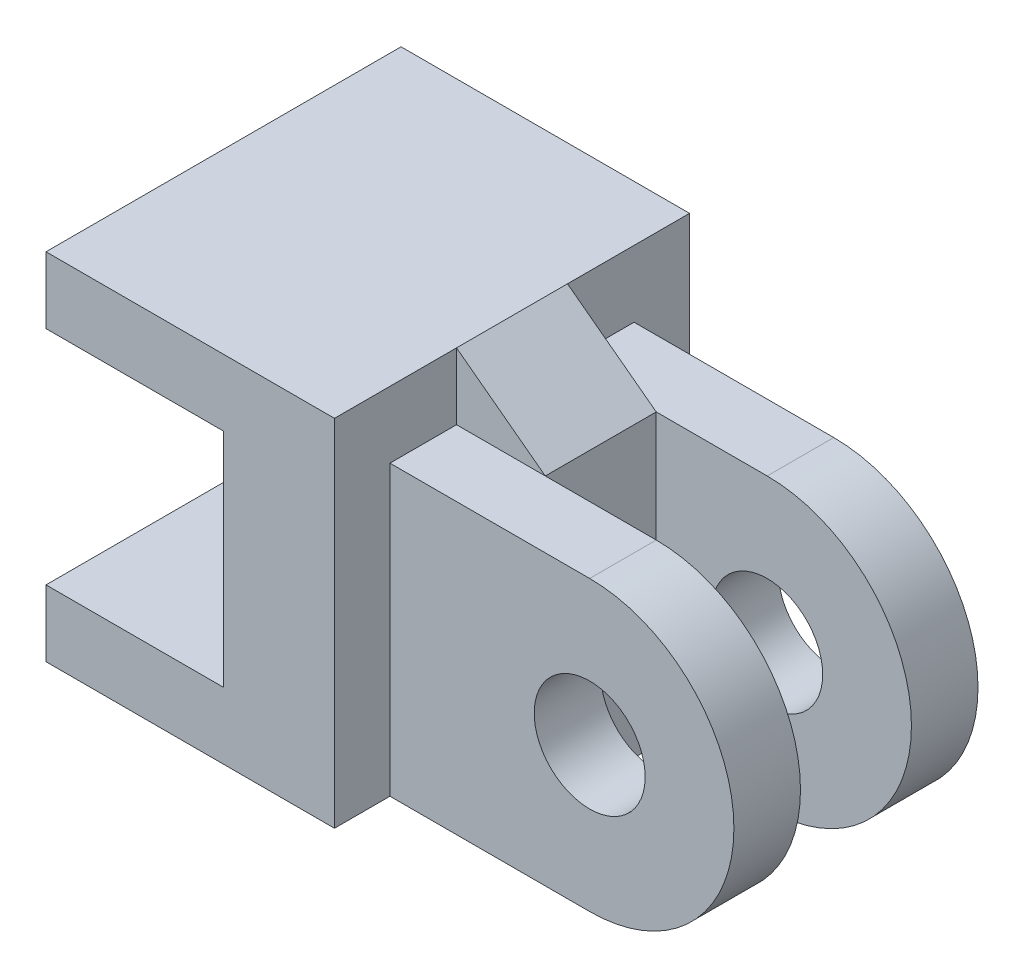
ISO-10303-21;
HEADER;
FILE_DESCRIPTION(('STEP AP214'),'2;1');
FILE_NAME('part.step','',(''),(''),'','','');
FILE_SCHEMA(('AUTOMOTIVE_DESIGN { 1 0 10303 214 1 1 1 1 }'));
ENDSEC;
DATA;
#1=APPLICATION_CONTEXT('core data for automotive mechanical design processes');
#2=APPLICATION_PROTOCOL_DEFINITION('international standard','automotive_design',2000,#1);
#3=PRODUCT_CONTEXT('',#1,'mechanical');
#4=PRODUCT('Part','Part','',(#3));
#5=PRODUCT_RELATED_PRODUCT_CATEGORY('part','',(#4));
#6=PRODUCT_DEFINITION_FORMATION('','',#4);
#7=PRODUCT_DEFINITION_CONTEXT('part definition',#1,'design');
#8=PRODUCT_DEFINITION('design','',#6,#7);
#9=PRODUCT_DEFINITION_SHAPE('','',#8);
#10=(LENGTH_UNIT() NAMED_UNIT(*) SI_UNIT(.MILLI.,.METRE.));
#11=(NAMED_UNIT(*) PLANE_ANGLE_UNIT() SI_UNIT($,.RADIAN.));
#12=(NAMED_UNIT(*) SI_UNIT($,.STERADIAN.) SOLID_ANGLE_UNIT());
#13=UNCERTAINTY_MEASURE_WITH_UNIT(LENGTH_MEASURE(1.E-05),#10,'distance_accuracy_value','');
#14=(GEOMETRIC_REPRESENTATION_CONTEXT(3) GLOBAL_UNCERTAINTY_ASSIGNED_CONTEXT((#13)) GLOBAL_UNIT_ASSIGNED_CONTEXT((#10,
#11,#12)) REPRESENTATION_CONTEXT('',''));
#15=CARTESIAN_POINT('',(0.,0.,0.));
#16=DIRECTION('',(0.,0.,1.));
#17=DIRECTION('',(1.,0.,0.));
#18=AXIS2_PLACEMENT_3D('',#15,#16,#17);
#19=CARTESIAN_POINT('',(25.,-40.,-12.5));
#20=DIRECTION('',(0.,0.,1.));
#21=DIRECTION('',(1.,0.,0.));
#22=AXIS2_PLACEMENT_3D('',#19,#20,#21);
#23=PLANE('',#22);
#24=DIRECTION('',(1.,0.,0.));
#25=VECTOR('',#24,1.);
#26=CARTESIAN_POINT('',(25.,25.,-12.5));
#27=LINE('',#26,#25);
#28=CARTESIAN_POINT('',(25.,25.,-12.5));
#29=VERTEX_POINT('',#28);
#30=CARTESIAN_POINT('',(45.,25.,-12.5));
#31=VERTEX_POINT('',#30);
#32=EDGE_CURVE('E187',#29,#31,#27,.T.);
#33=ORIENTED_EDGE('',*,*,#32,.F.);
#34=DIRECTION('',(0.,-1.,0.));
#35=VECTOR('',#34,1.);
#36=CARTESIAN_POINT('',(25.,-40.,-12.5));
#37=LINE('',#36,#35);
#38=CARTESIAN_POINT('',(25.,40.,-12.5));
#39=VERTEX_POINT('',#38);
#40=EDGE_CURVE('E224',#39,#29,#37,.T.);
#41=ORIENTED_EDGE('',*,*,#40,.F.);
#42=DIRECTION('',(-0.8,0.6,0.));
#43=VECTOR('',#42,1.);
#44=CARTESIAN_POINT('',(25.,40.,-12.5));
#45=LINE('',#44,#43);
#46=EDGE_CURVE('E231',#31,#39,#45,.T.);
#47=ORIENTED_EDGE('',*,*,#46,.F.);
#48=EDGE_LOOP('',(#33,#41,#47));
#49=FACE_BOUND('',#48,.T.);
#50=ADVANCED_FACE('F33',(#49),#23,.F.);
#51=CARTESIAN_POINT('',(25.,-40.,12.5));
#52=DIRECTION('',(0.,0.,1.));
#53=DIRECTION('',(1.,0.,0.));
#54=AXIS2_PLACEMENT_3D('',#51,#52,#53);
#55=PLANE('',#54);
#56=DIRECTION('',(0.,-1.,0.));
#57=VECTOR('',#56,1.);
#58=CARTESIAN_POINT('',(25.,-40.,12.5));
#59=LINE('',#58,#57);
#60=CARTESIAN_POINT('',(25.,40.,12.5));
#61=VERTEX_POINT('',#60);
#62=CARTESIAN_POINT('',(25.,25.,12.5));
#63=VERTEX_POINT('',#62);
#64=EDGE_CURVE('E236',#61,#63,#59,.T.);
#65=ORIENTED_EDGE('',*,*,#64,.T.);
#66=DIRECTION('',(1.,0.,0.));
#67=VECTOR('',#66,1.);
#68=CARTESIAN_POINT('',(25.,25.,12.5));
#69=LINE('',#68,#67);
#70=CARTESIAN_POINT('',(45.,25.,12.5));
#71=VERTEX_POINT('',#70);
#72=EDGE_CURVE('E11',#63,#71,#69,.T.);
#73=ORIENTED_EDGE('',*,*,#72,.T.);
#74=DIRECTION('',(-0.8,0.6,0.));
#75=VECTOR('',#74,1.);
#76=CARTESIAN_POINT('',(25.,40.,12.5));
#77=LINE('',#76,#75);
#78=EDGE_CURVE('E243',#71,#61,#77,.T.);
#79=ORIENTED_EDGE('',*,*,#78,.T.);
#80=EDGE_LOOP('',(#65,#73,#79));
#81=FACE_BOUND('',#80,.T.);
#82=ADVANCED_FACE('F335',(#81),#55,.T.);
#83=CARTESIAN_POINT('',(25.,40.,40.));
#84=DIRECTION('',(-1.,0.,0.));
#85=DIRECTION('',(0.,0.,1.));
#86=AXIS2_PLACEMENT_3D('',#83,#84,#85);
#87=PLANE('',#86);
#88=DIRECTION('',(0.,0.,-1.));
#89=VECTOR('',#88,1.);
#90=CARTESIAN_POINT('',(25.,-40.,40.));
#91=LINE('',#90,#89);
#92=CARTESIAN_POINT('',(25.,-40.,40.));
#93=VERTEX_POINT('',#92);
#94=CARTESIAN_POINT('',(25.,-40.,27.5));
#95=VERTEX_POINT('',#94);
#96=EDGE_CURVE('E251',#93,#95,#91,.T.);
#97=ORIENTED_EDGE('',*,*,#96,.T.);
#98=DIRECTION('',(0.,-1.,0.));
#99=VECTOR('',#98,1.);
#100=CARTESIAN_POINT('',(25.,25.,27.5));
#101=LINE('',#100,#99);
#102=CARTESIAN_POINT('',(25.,25.,27.5));
#103=VERTEX_POINT('',#102);
#104=EDGE_CURVE('E206',#103,#95,#101,.T.);
#105=ORIENTED_EDGE('',*,*,#104,.F.);
#106=DIRECTION('',(0.,0.,-1.));
#107=VECTOR('',#106,1.);
#108=CARTESIAN_POINT('',(25.,25.,27.5));
#109=LINE('',#108,#107);
#110=EDGE_CURVE('E215',#103,#63,#109,.T.);
#111=ORIENTED_EDGE('',*,*,#110,.T.);
#112=ORIENTED_EDGE('',*,*,#64,.F.);
#113=DIRECTION('',(0.,0.,-1.));
#114=VECTOR('',#113,1.);
#115=CARTESIAN_POINT('',(25.,40.,40.));
#116=LINE('',#115,#114);
#117=CARTESIAN_POINT('',(25.,40.,40.));
#118=VERTEX_POINT('',#117);
#119=EDGE_CURVE('E272',#118,#61,#116,.T.);
#120=ORIENTED_EDGE('',*,*,#119,.F.);
#121=DIRECTION('',(0.,1.,0.));
#122=VECTOR('',#121,1.);
#123=CARTESIAN_POINT('',(25.,40.,40.));
#124=LINE('',#123,#122);
#125=EDGE_CURVE('E292',#93,#118,#124,.T.);
#126=ORIENTED_EDGE('',*,*,#125,.F.);
#127=EDGE_LOOP('',(#97,#105,#111,#112,#120,#126));
#128=FACE_BOUND('',#127,.T.);
#129=ADVANCED_FACE('F357',(#128),#87,.F.);
#130=CARTESIAN_POINT('',(0.,25.,40.));
#131=DIRECTION('',(0.,1.,0.));
#132=DIRECTION('',(-1.,0.,0.));
#133=AXIS2_PLACEMENT_3D('',#130,#131,#132);
#134=PLANE('',#133);
#135=DIRECTION('',(1.,0.,0.));
#136=VECTOR('',#135,1.);
#137=CARTESIAN_POINT('',(0.,25.,-40.));
#138=LINE('',#137,#136);
#139=CARTESIAN_POINT('',(-40.,25.,-40.));
#140=VERTEX_POINT('',#139);
#141=CARTESIAN_POINT('',(0.,25.,-40.));
#142=VERTEX_POINT('',#141);
#143=EDGE_CURVE('E320',#140,#142,#138,.T.);
#144=ORIENTED_EDGE('',*,*,#143,.T.);
#145=DIRECTION('',(0.,0.,-1.));
#146=VECTOR('',#145,1.);
#147=CARTESIAN_POINT('',(0.,25.,40.));
#148=LINE('',#147,#146);
#149=CARTESIAN_POINT('',(0.,25.,40.));
#150=VERTEX_POINT('',#149);
#151=EDGE_CURVE('E43',#150,#142,#148,.T.);
#152=ORIENTED_EDGE('',*,*,#151,.F.);
#153=DIRECTION('',(1.,0.,0.));
#154=VECTOR('',#153,1.);
#155=CARTESIAN_POINT('',(0.,25.,40.));
#156=LINE('',#155,#154);
#157=CARTESIAN_POINT('',(-40.,25.,40.));
#158=VERTEX_POINT('',#157);
#159=EDGE_CURVE('E302',#158,#150,#156,.T.);
#160=ORIENTED_EDGE('',*,*,#159,.F.);
#161=DIRECTION('',(0.,0.,-1.));
#162=VECTOR('',#161,1.);
#163=CARTESIAN_POINT('',(-40.,25.,40.));
#164=LINE('',#163,#162);
#165=EDGE_CURVE('E280',#158,#140,#164,.T.);
#166=ORIENTED_EDGE('',*,*,#165,.T.);
#167=EDGE_LOOP('',(#144,#152,#160,#166));
#168=FACE_BOUND('',#167,.T.);
#169=ADVANCED_FACE('F35',(#168),#134,.F.);
#170=CARTESIAN_POINT('',(0.,-25.,40.));
#171=DIRECTION('',(1.,0.,0.));
#172=DIRECTION('',(0.,0.,-1.));
#173=AXIS2_PLACEMENT_3D('',#170,#171,#172);
#174=PLANE('',#173);
#175=DIRECTION('',(0.,-1.,0.));
#176=VECTOR('',#175,1.);
#177=CARTESIAN_POINT('',(0.,-25.,-40.));
#178=LINE('',#177,#176);
#179=CARTESIAN_POINT('',(0.,-25.,-40.));
#180=VERTEX_POINT('',#179);
#181=EDGE_CURVE('E318',#142,#180,#178,.T.);
#182=ORIENTED_EDGE('',*,*,#181,.T.);
#183=DIRECTION('',(0.,0.,-1.));
#184=VECTOR('',#183,1.);
#185=CARTESIAN_POINT('',(0.,-25.,40.));
#186=LINE('',#185,#184);
#187=CARTESIAN_POINT('',(0.,-25.,40.));
#188=VERTEX_POINT('',#187);
#189=EDGE_CURVE('E268',#188,#180,#186,.T.);
#190=ORIENTED_EDGE('',*,*,#189,.F.);
#191=DIRECTION('',(0.,-1.,0.));
#192=VECTOR('',#191,1.);
#193=CARTESIAN_POINT('',(0.,-25.,40.));
#194=LINE('',#193,#192);
#195=EDGE_CURVE('E300',#150,#188,#194,.T.);
#196=ORIENTED_EDGE('',*,*,#195,.F.);
#197=ORIENTED_EDGE('',*,*,#151,.T.);
#198=EDGE_LOOP('',(#182,#190,#196,#197));
#199=FACE_BOUND('',#198,.T.);
#200=ADVANCED_FACE('F388',(#199),#174,.F.);
#201=CARTESIAN_POINT('',(0.,-25.,40.));
#202=DIRECTION('',(0.,-1.,0.));
#203=DIRECTION('',(1.,0.,0.));
#204=AXIS2_PLACEMENT_3D('',#201,#202,#203);
#205=PLANE('',#204);
#206=DIRECTION('',(-1.,0.,0.));
#207=VECTOR('',#206,1.);
#208=CARTESIAN_POINT('',(0.,-25.,-40.));
#209=LINE('',#208,#207);
#210=CARTESIAN_POINT('',(-40.,-25.,-40.));
#211=VERTEX_POINT('',#210);
#212=EDGE_CURVE('E316',#180,#211,#209,.T.);
#213=ORIENTED_EDGE('',*,*,#212,.T.);
#214=DIRECTION('',(0.,0.,-1.));
#215=VECTOR('',#214,1.);
#216=CARTESIAN_POINT('',(-40.,-25.,40.));
#217=LINE('',#216,#215);
#218=CARTESIAN_POINT('',(-40.,-25.,40.));
#219=VERTEX_POINT('',#218);
#220=EDGE_CURVE('E265',#219,#211,#217,.T.);
#221=ORIENTED_EDGE('',*,*,#220,.F.);
#222=DIRECTION('',(-1.,0.,0.));
#223=VECTOR('',#222,1.);
#224=CARTESIAN_POINT('',(0.,-25.,40.));
#225=LINE('',#224,#223);
#226=EDGE_CURVE('E298',#188,#219,#225,.T.);
#227=ORIENTED_EDGE('',*,*,#226,.F.);
#228=ORIENTED_EDGE('',*,*,#189,.T.);
#229=EDGE_LOOP('',(#213,#221,#227,#228));
#230=FACE_BOUND('',#229,.T.);
#231=ADVANCED_FACE('F393',(#230),#205,.F.);
#232=CARTESIAN_POINT('',(-40.,-25.,40.));
#233=DIRECTION('',(1.,0.,0.));
#234=DIRECTION('',(0.,0.,-1.));
#235=AXIS2_PLACEMENT_3D('',#232,#233,#234);
#236=PLANE('',#235);
#237=DIRECTION('',(0.,-1.,0.));
#238=VECTOR('',#237,1.);
#239=CARTESIAN_POINT('',(-40.,-25.,-40.));
#240=LINE('',#239,#238);
#241=CARTESIAN_POINT('',(-40.,-40.,-40.));
#242=VERTEX_POINT('',#241);
#243=EDGE_CURVE('E314',#211,#242,#240,.T.);
#244=ORIENTED_EDGE('',*,*,#243,.T.);
#245=DIRECTION('',(0.,0.,-1.));
#246=VECTOR('',#245,1.);
#247=CARTESIAN_POINT('',(-40.,-40.,40.));
#248=LINE('',#247,#246);
#249=CARTESIAN_POINT('',(-40.,-40.,40.));
#250=VERTEX_POINT('',#249);
#251=EDGE_CURVE('E254',#250,#242,#248,.T.);
#252=ORIENTED_EDGE('',*,*,#251,.F.);
#253=DIRECTION('',(0.,-1.,0.));
#254=VECTOR('',#253,1.);
#255=CARTESIAN_POINT('',(-40.,-25.,40.));
#256=LINE('',#255,#254);
#257=EDGE_CURVE('E296',#219,#250,#256,.T.);
#258=ORIENTED_EDGE('',*,*,#257,.F.);
#259=ORIENTED_EDGE('',*,*,#220,.T.);
#260=EDGE_LOOP('',(#244,#252,#258,#259));
#261=FACE_BOUND('',#260,.T.);
#262=ADVANCED_FACE('F399',(#261),#236,.F.);
#263=CARTESIAN_POINT('',(-40.,-40.,40.));
#264=DIRECTION('',(0.,1.,0.));
#265=DIRECTION('',(-1.,0.,0.));
#266=AXIS2_PLACEMENT_3D('',#263,#264,#265);
#267=PLANE('',#266);
#268=DIRECTION('',(1.,0.,0.));
#269=VECTOR('',#268,1.);
#270=CARTESIAN_POINT('',(25.,-40.,27.5));
#271=LINE('',#270,#269);
#272=CARTESIAN_POINT('',(70.,-40.,27.5));
#273=VERTEX_POINT('',#272);
#274=EDGE_CURVE('E209',#95,#273,#271,.T.);
#275=ORIENTED_EDGE('',*,*,#274,.F.);
#276=ORIENTED_EDGE('',*,*,#96,.F.);
#277=DIRECTION('',(1.,0.,0.));
#278=VECTOR('',#277,1.);
#279=CARTESIAN_POINT('',(-40.,-40.,40.));
#280=LINE('',#279,#278);
#281=EDGE_CURVE('E294',#250,#93,#280,.T.);
#282=ORIENTED_EDGE('',*,*,#281,.F.);
#283=ORIENTED_EDGE('',*,*,#251,.T.);
#284=DIRECTION('',(1.,0.,0.));
#285=VECTOR('',#284,1.);
#286=CARTESIAN_POINT('',(-40.,-40.,-40.));
#287=LINE('',#286,#285);
#288=CARTESIAN_POINT('',(25.,-40.,-40.));
#289=VERTEX_POINT('',#288);
#290=EDGE_CURVE('E311',#242,#289,#287,.T.);
#291=ORIENTED_EDGE('',*,*,#290,.T.);
#292=CARTESIAN_POINT('',(25.,-40.,-27.5));
#293=VERTEX_POINT('',#292);
#294=EDGE_CURVE('E37',#293,#289,#91,.T.);
#295=ORIENTED_EDGE('',*,*,#294,.F.);
#296=DIRECTION('',(1.,0.,0.));
#297=VECTOR('',#296,1.);
#298=CARTESIAN_POINT('',(25.,-40.,-27.5));
#299=LINE('',#298,#297);
#300=CARTESIAN_POINT('',(70.,-40.,-27.5));
#301=VERTEX_POINT('',#300);
#302=EDGE_CURVE('E185',#293,#301,#299,.T.);
#303=ORIENTED_EDGE('',*,*,#302,.T.);
#304=DIRECTION('',(0.,0.,1.));
#305=VECTOR('',#304,1.);
#306=CARTESIAN_POINT('',(70.,-40.,-27.5));
#307=LINE('',#306,#305);
#308=CARTESIAN_POINT('',(70.,-40.,-12.5));
#309=VERTEX_POINT('',#308);
#310=EDGE_CURVE('E165',#301,#309,#307,.T.);
#311=ORIENTED_EDGE('',*,*,#310,.T.);
#312=DIRECTION('',(1.,0.,0.));
#313=VECTOR('',#312,1.);
#314=CARTESIAN_POINT('',(25.,-40.,-12.5));
#315=LINE('',#314,#313);
#316=CARTESIAN_POINT('',(45.,-40.,-12.5));
#317=VERTEX_POINT('',#316);
#318=EDGE_CURVE('E172',#317,#309,#315,.T.);
#319=ORIENTED_EDGE('',*,*,#318,.F.);
#320=DIRECTION('',(0.,0.,-1.));
#321=VECTOR('',#320,1.);
#322=CARTESIAN_POINT('',(45.,-40.,12.5));
#323=LINE('',#322,#321);
#324=CARTESIAN_POINT('',(45.,-40.,12.5));
#325=VERTEX_POINT('',#324);
#326=EDGE_CURVE('E323',#325,#317,#323,.T.);
#327=ORIENTED_EDGE('',*,*,#326,.F.);
#328=DIRECTION('',(1.,0.,0.));
#329=VECTOR('',#328,1.);
#330=CARTESIAN_POINT('',(25.,-40.,12.5));
#331=LINE('',#330,#329);
#332=CARTESIAN_POINT('',(70.,-40.,12.5));
#333=VERTEX_POINT('',#332);
#334=EDGE_CURVE('E200',#325,#333,#331,.T.);
#335=ORIENTED_EDGE('',*,*,#334,.T.);
#336=DIRECTION('',(0.,0.,-1.));
#337=VECTOR('',#336,1.);
#338=CARTESIAN_POINT('',(70.,-40.,27.5));
#339=LINE('',#338,#337);
#340=EDGE_CURVE('E221',#273,#333,#339,.T.);
#341=ORIENTED_EDGE('',*,*,#340,.F.);
#342=EDGE_LOOP('',(#275,#276,#282,#283,#291,#295,#303,#311,#319,#327,#335,#341));
#343=FACE_BOUND('',#342,.T.);
#344=ADVANCED_FACE('F183',(#343),#267,.F.);
#345=DIRECTION('',(0.,0.,1.));
#346=VECTOR('',#345,1.);
#347=CARTESIAN_POINT('',(25.,25.,-27.5));
#348=LINE('',#347,#346);
#349=CARTESIAN_POINT('',(25.,25.,-27.5));
#350=VERTEX_POINT('',#349);
#351=EDGE_CURVE('E50',#350,#29,#348,.T.);
#352=ORIENTED_EDGE('',*,*,#351,.F.);
#353=DIRECTION('',(0.,-1.,0.));
#354=VECTOR('',#353,1.);
#355=CARTESIAN_POINT('',(25.,25.,-27.5));
#356=LINE('',#355,#354);
#357=EDGE_CURVE('E55',#350,#293,#356,.T.);
#358=ORIENTED_EDGE('',*,*,#357,.T.);
#359=ORIENTED_EDGE('',*,*,#294,.T.);
#360=DIRECTION('',(0.,1.,0.));
#361=VECTOR('',#360,1.);
#362=CARTESIAN_POINT('',(25.,40.,-40.));
#363=LINE('',#362,#361);
#364=CARTESIAN_POINT('',(25.,40.,-40.));
#365=VERTEX_POINT('',#364);
#366=EDGE_CURVE('E309',#289,#365,#363,.T.);
#367=ORIENTED_EDGE('',*,*,#366,.T.);
#368=EDGE_CURVE('E255',#39,#365,#116,.T.);
#369=ORIENTED_EDGE('',*,*,#368,.F.);
#370=ORIENTED_EDGE('',*,*,#40,.T.);
#371=EDGE_LOOP('',(#352,#358,#359,#367,#369,#370));
#372=FACE_BOUND('',#371,.T.);
#373=ADVANCED_FACE('F348',(#372),#87,.F.);
#374=CARTESIAN_POINT('',(-40.,40.,40.));
#375=DIRECTION('',(0.,-1.,0.));
#376=DIRECTION('',(1.,0.,0.));
#377=AXIS2_PLACEMENT_3D('',#374,#375,#376);
#378=PLANE('',#377);
#379=DIRECTION('',(-1.,0.,0.));
#380=VECTOR('',#379,1.);
#381=CARTESIAN_POINT('',(-40.,40.,-40.));
#382=LINE('',#381,#380);
#383=CARTESIAN_POINT('',(-40.,40.,-40.));
#384=VERTEX_POINT('',#383);
#385=EDGE_CURVE('E307',#365,#384,#382,.T.);
#386=ORIENTED_EDGE('',*,*,#385,.T.);
#387=DIRECTION('',(0.,0.,-1.));
#388=VECTOR('',#387,1.);
#389=CARTESIAN_POINT('',(-40.,40.,40.));
#390=LINE('',#389,#388);
#391=CARTESIAN_POINT('',(-40.,40.,40.));
#392=VERTEX_POINT('',#391);
#393=EDGE_CURVE('E277',#392,#384,#390,.T.);
#394=ORIENTED_EDGE('',*,*,#393,.F.);
#395=DIRECTION('',(-1.,0.,0.));
#396=VECTOR('',#395,1.);
#397=CARTESIAN_POINT('',(-40.,40.,40.));
#398=LINE('',#397,#396);
#399=EDGE_CURVE('E290',#118,#392,#398,.T.);
#400=ORIENTED_EDGE('',*,*,#399,.F.);
#401=ORIENTED_EDGE('',*,*,#119,.T.);
#402=DIRECTION('',(0.,0.,-1.));
#403=VECTOR('',#402,1.);
#404=CARTESIAN_POINT('',(25.,40.,12.5));
#405=LINE('',#404,#403);
#406=EDGE_CURVE('E239',#61,#39,#405,.T.);
#407=ORIENTED_EDGE('',*,*,#406,.T.);
#408=ORIENTED_EDGE('',*,*,#368,.T.);
#409=EDGE_LOOP('',(#386,#394,#400,#401,#407,#408));
#410=FACE_BOUND('',#409,.T.);
#411=ADVANCED_FACE('F344',(#410),#378,.F.);
#412=CARTESIAN_POINT('',(-40.,25.,40.));
#413=DIRECTION('',(1.,0.,0.));
#414=DIRECTION('',(0.,0.,-1.));
#415=AXIS2_PLACEMENT_3D('',#412,#413,#414);
#416=PLANE('',#415);
#417=DIRECTION('',(0.,-1.,0.));
#418=VECTOR('',#417,1.);
#419=CARTESIAN_POINT('',(-40.,25.,-40.));
#420=LINE('',#419,#418);
#421=EDGE_CURVE('E305',#384,#140,#420,.T.);
#422=ORIENTED_EDGE('',*,*,#421,.T.);
#423=ORIENTED_EDGE('',*,*,#165,.F.);
#424=DIRECTION('',(0.,-1.,0.));
#425=VECTOR('',#424,1.);
#426=CARTESIAN_POINT('',(-40.,25.,40.));
#427=LINE('',#426,#425);
#428=EDGE_CURVE('E286',#392,#158,#427,.T.);
#429=ORIENTED_EDGE('',*,*,#428,.F.);
#430=ORIENTED_EDGE('',*,*,#393,.T.);
#431=EDGE_LOOP('',(#422,#423,#429,#430));
#432=FACE_BOUND('',#431,.T.);
#433=ADVANCED_FACE('F347',(#432),#416,.F.);
#434=CARTESIAN_POINT('',(-40.,25.,40.));
#435=DIRECTION('',(0.,0.,-1.));
#436=DIRECTION('',(-1.,0.,0.));
#437=AXIS2_PLACEMENT_3D('',#434,#435,#436);
#438=PLANE('',#437);
#439=ORIENTED_EDGE('',*,*,#159,.T.);
#440=ORIENTED_EDGE('',*,*,#195,.T.);
#441=ORIENTED_EDGE('',*,*,#226,.T.);
#442=ORIENTED_EDGE('',*,*,#257,.T.);
#443=ORIENTED_EDGE('',*,*,#281,.T.);
#444=ORIENTED_EDGE('',*,*,#125,.T.);
#445=ORIENTED_EDGE('',*,*,#399,.T.);
#446=ORIENTED_EDGE('',*,*,#428,.T.);
#447=EDGE_LOOP('',(#439,#440,#441,#442,#443,#444,#445,#446));
#448=FACE_BOUND('',#447,.T.);
#449=ADVANCED_FACE('F354',(#448),#438,.F.);
#450=CARTESIAN_POINT('',(-40.,25.,-40.));
#451=DIRECTION('',(0.,0.,-1.));
#452=DIRECTION('',(-1.,0.,0.));
#453=AXIS2_PLACEMENT_3D('',#450,#451,#452);
#454=PLANE('',#453);
#455=ORIENTED_EDGE('',*,*,#143,.F.);
#456=ORIENTED_EDGE('',*,*,#421,.F.);
#457=ORIENTED_EDGE('',*,*,#385,.F.);
#458=ORIENTED_EDGE('',*,*,#366,.F.);
#459=ORIENTED_EDGE('',*,*,#290,.F.);
#460=ORIENTED_EDGE('',*,*,#243,.F.);
#461=ORIENTED_EDGE('',*,*,#212,.F.);
#462=ORIENTED_EDGE('',*,*,#181,.F.);
#463=EDGE_LOOP('',(#455,#456,#457,#458,#459,#460,#461,#462));
#464=FACE_BOUND('',#463,.T.);
#465=ADVANCED_FACE('F373',(#464),#454,.T.);
#466=CARTESIAN_POINT('',(45.,25.,12.5));
#467=DIRECTION('',(-1.,0.,0.));
#468=DIRECTION('',(0.,-1.,0.));
#469=AXIS2_PLACEMENT_3D('',#466,#467,#468);
#470=PLANE('',#469);
#471=DIRECTION('',(0.,1.,0.));
#472=VECTOR('',#471,1.);
#473=CARTESIAN_POINT('',(45.,25.,-12.5));
#474=LINE('',#473,#472);
#475=EDGE_CURVE('E178',#317,#31,#474,.T.);
#476=ORIENTED_EDGE('',*,*,#475,.T.);
#477=DIRECTION('',(0.,0.,-1.));
#478=VECTOR('',#477,1.);
#479=CARTESIAN_POINT('',(45.,25.,12.5));
#480=LINE('',#479,#478);
#481=EDGE_CURVE('E242',#71,#31,#480,.T.);
#482=ORIENTED_EDGE('',*,*,#481,.F.);
#483=DIRECTION('',(0.,1.,0.));
#484=VECTOR('',#483,1.);
#485=CARTESIAN_POINT('',(45.,25.,12.5));
#486=LINE('',#485,#484);
#487=EDGE_CURVE('E248',#325,#71,#486,.T.);
#488=ORIENTED_EDGE('',*,*,#487,.F.);
#489=ORIENTED_EDGE('',*,*,#326,.T.);
#490=EDGE_LOOP('',(#476,#482,#488,#489));
#491=FACE_BOUND('',#490,.T.);
#492=ADVANCED_FACE('F340',(#491),#470,.F.);
#493=CARTESIAN_POINT('',(25.,40.,12.5));
#494=DIRECTION('',(-0.599999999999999,-0.8,0.));
#495=DIRECTION('',(0.800000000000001,-0.6,0.));
#496=AXIS2_PLACEMENT_3D('',#493,#494,#495);
#497=PLANE('',#496);
#498=ORIENTED_EDGE('',*,*,#46,.T.);
#499=ORIENTED_EDGE('',*,*,#406,.F.);
#500=ORIENTED_EDGE('',*,*,#78,.F.);
#501=ORIENTED_EDGE('',*,*,#481,.T.);
#502=EDGE_LOOP('',(#498,#499,#500,#501));
#503=FACE_BOUND('',#502,.T.);
#504=ADVANCED_FACE('F342',(#503),#497,.F.);
#505=CARTESIAN_POINT('',(70.,-7.49999999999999,12.5));
#506=DIRECTION('',(0.,0.,1.));
#507=DIRECTION('',(1.,0.,0.));
#508=AXIS2_PLACEMENT_3D('',#505,#506,#507);
#509=PLANE('',#508);
#510=CARTESIAN_POINT('',(70.,-7.49999999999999,12.5));
#511=DIRECTION('',(0.,0.,1.));
#512=DIRECTION('',(1.,0.,0.));
#513=AXIS2_PLACEMENT_3D('',#510,#511,#512);
#514=CIRCLE('',#513,12.5);
#515=CARTESIAN_POINT('',(82.5,-7.49999999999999,12.5));
#516=VERTEX_POINT('',#515);
#517=EDGE_CURVE('E194',#516,#516,#514,.T.);
#518=ORIENTED_EDGE('',*,*,#517,.T.);
#519=EDGE_LOOP('',(#518));
#520=FACE_BOUND('',#519,.T.);
#521=ORIENTED_EDGE('',*,*,#334,.F.);
#522=ORIENTED_EDGE('',*,*,#487,.T.);
#523=DIRECTION('',(-1.,0.,0.));
#524=VECTOR('',#523,1.);
#525=CARTESIAN_POINT('',(70.,25.,12.5));
#526=LINE('',#525,#524);
#527=CARTESIAN_POINT('',(70.,25.,12.5));
#528=VERTEX_POINT('',#527);
#529=EDGE_CURVE('E204',#528,#71,#526,.T.);
#530=ORIENTED_EDGE('',*,*,#529,.F.);
#531=CARTESIAN_POINT('',(70.,-7.49999999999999,12.5));
#532=DIRECTION('',(0.,0.,1.));
#533=DIRECTION('',(1.,0.,0.));
#534=AXIS2_PLACEMENT_3D('',#531,#532,#533);
#535=CIRCLE('',#534,32.5);
#536=EDGE_CURVE('E202',#333,#528,#535,.T.);
#537=ORIENTED_EDGE('',*,*,#536,.F.);
#538=EDGE_LOOP('',(#521,#522,#530,#537));
#539=FACE_BOUND('',#538,.T.);
#540=ADVANCED_FACE('F330',(#520,#539),#509,.F.);
#541=CARTESIAN_POINT('',(70.,-7.49999999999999,27.5));
#542=DIRECTION('',(0.,0.,1.));
#543=DIRECTION('',(1.,0.,0.));
#544=AXIS2_PLACEMENT_3D('',#541,#542,#543);
#545=PLANE('',#544);
#546=ORIENTED_EDGE('',*,*,#104,.T.);
#547=ORIENTED_EDGE('',*,*,#274,.T.);
#548=CARTESIAN_POINT('',(70.,-7.49999999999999,27.5));
#549=DIRECTION('',(0.,0.,1.));
#550=DIRECTION('',(1.,0.,0.));
#551=AXIS2_PLACEMENT_3D('',#548,#549,#550);
#552=CIRCLE('',#551,32.5);
#553=CARTESIAN_POINT('',(70.,25.,27.5));
#554=VERTEX_POINT('',#553);
#555=EDGE_CURVE('E211',#273,#554,#552,.T.);
#556=ORIENTED_EDGE('',*,*,#555,.T.);
#557=DIRECTION('',(-1.,0.,0.));
#558=VECTOR('',#557,1.);
#559=CARTESIAN_POINT('',(70.,25.,27.5));
#560=LINE('',#559,#558);
#561=EDGE_CURVE('E213',#554,#103,#560,.T.);
#562=ORIENTED_EDGE('',*,*,#561,.T.);
#563=EDGE_LOOP('',(#546,#547,#556,#562));
#564=FACE_BOUND('',#563,.T.);
#565=CARTESIAN_POINT('',(70.,-7.49999999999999,27.5));
#566=DIRECTION('',(0.,0.,1.));
#567=DIRECTION('',(1.,0.,0.));
#568=AXIS2_PLACEMENT_3D('',#565,#566,#567);
#569=CIRCLE('',#568,12.5);
#570=CARTESIAN_POINT('',(82.5,-7.49999999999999,27.5));
#571=VERTEX_POINT('',#570);
#572=EDGE_CURVE('E197',#571,#571,#569,.T.);
#573=ORIENTED_EDGE('',*,*,#572,.F.);
#574=EDGE_LOOP('',(#573));
#575=FACE_BOUND('',#574,.T.);
#576=ADVANCED_FACE('F448',(#564,#575),#545,.T.);
#577=CARTESIAN_POINT('',(70.,-7.49999999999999,27.5));
#578=DIRECTION('',(0.,0.,-1.));
#579=DIRECTION('',(-1.,0.,0.));
#580=AXIS2_PLACEMENT_3D('',#577,#578,#579);
#581=CYLINDRICAL_SURFACE('',#580,32.5);
#582=ORIENTED_EDGE('',*,*,#536,.T.);
#583=DIRECTION('',(0.,0.,-1.));
#584=VECTOR('',#583,1.);
#585=CARTESIAN_POINT('',(70.,25.,27.5));
#586=LINE('',#585,#584);
#587=EDGE_CURVE('E218',#554,#528,#586,.T.);
#588=ORIENTED_EDGE('',*,*,#587,.F.);
#589=ORIENTED_EDGE('',*,*,#555,.F.);
#590=ORIENTED_EDGE('',*,*,#340,.T.);
#591=EDGE_LOOP('',(#582,#588,#589,#590));
#592=FACE_BOUND('',#591,.T.);
#593=ADVANCED_FACE('F366',(#592),#581,.T.);
#594=CARTESIAN_POINT('',(70.,25.,27.5));
#595=DIRECTION('',(0.,-1.,0.));
#596=DIRECTION('',(1.,0.,0.));
#597=AXIS2_PLACEMENT_3D('',#594,#595,#596);
#598=PLANE('',#597);
#599=ORIENTED_EDGE('',*,*,#529,.T.);
#600=ORIENTED_EDGE('',*,*,#72,.F.);
#601=ORIENTED_EDGE('',*,*,#110,.F.);
#602=ORIENTED_EDGE('',*,*,#561,.F.);
#603=ORIENTED_EDGE('',*,*,#587,.T.);
#604=EDGE_LOOP('',(#599,#600,#601,#602,#603));
#605=FACE_BOUND('',#604,.T.);
#606=ADVANCED_FACE('F437',(#605),#598,.F.);
#607=CARTESIAN_POINT('',(70.,-7.49999999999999,27.5));
#608=DIRECTION('',(0.,0.,-1.));
#609=DIRECTION('',(-1.,0.,0.));
#610=AXIS2_PLACEMENT_3D('',#607,#608,#609);
#611=CYLINDRICAL_SURFACE('',#610,12.5);
#612=ORIENTED_EDGE('',*,*,#572,.T.);
#613=EDGE_LOOP('',(#612));
#614=FACE_BOUND('',#613,.T.);
#615=ORIENTED_EDGE('',*,*,#517,.F.);
#616=EDGE_LOOP('',(#615));
#617=FACE_BOUND('',#616,.T.);
#618=ADVANCED_FACE('F430',(#614,#617),#611,.F.);
#619=CARTESIAN_POINT('',(70.,-7.49999999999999,-12.5));
#620=DIRECTION('',(0.,0.,-1.));
#621=DIRECTION('',(1.,0.,0.));
#622=AXIS2_PLACEMENT_3D('',#619,#620,#621);
#623=PLANE('',#622);
#624=CARTESIAN_POINT('',(70.,-7.49999999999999,-12.5));
#625=DIRECTION('',(0.,0.,1.));
#626=DIRECTION('',(1.,0.,0.));
#627=AXIS2_PLACEMENT_3D('',#624,#625,#626);
#628=CIRCLE('',#627,12.5);
#629=CARTESIAN_POINT('',(82.5,-7.49999999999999,-12.5));
#630=VERTEX_POINT('',#629);
#631=EDGE_CURVE('E423',#630,#630,#628,.T.);
#632=ORIENTED_EDGE('',*,*,#631,.F.);
#633=EDGE_LOOP('',(#632));
#634=FACE_BOUND('',#633,.T.);
#635=ORIENTED_EDGE('',*,*,#318,.T.);
#636=CARTESIAN_POINT('',(70.,-7.49999999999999,-12.5));
#637=DIRECTION('',(0.,0.,1.));
#638=DIRECTION('',(1.,0.,0.));
#639=AXIS2_PLACEMENT_3D('',#636,#637,#638);
#640=CIRCLE('',#639,32.5);
#641=CARTESIAN_POINT('',(70.,25.,-12.5));
#642=VERTEX_POINT('',#641);
#643=EDGE_CURVE('E160',#309,#642,#640,.T.);
#644=ORIENTED_EDGE('',*,*,#643,.T.);
#645=DIRECTION('',(-1.,0.,0.));
#646=VECTOR('',#645,1.);
#647=CARTESIAN_POINT('',(70.,25.,-12.5));
#648=LINE('',#647,#646);
#649=EDGE_CURVE('E171',#642,#31,#648,.T.);
#650=ORIENTED_EDGE('',*,*,#649,.T.);
#651=ORIENTED_EDGE('',*,*,#475,.F.);
#652=EDGE_LOOP('',(#635,#644,#650,#651));
#653=FACE_BOUND('',#652,.T.);
#654=ADVANCED_FACE('F176',(#634,#653),#623,.F.);
#655=CARTESIAN_POINT('',(70.,-7.49999999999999,-27.5));
#656=DIRECTION('',(0.,0.,-1.));
#657=DIRECTION('',(1.,0.,0.));
#658=AXIS2_PLACEMENT_3D('',#655,#656,#657);
#659=PLANE('',#658);
#660=ORIENTED_EDGE('',*,*,#357,.F.);
#661=DIRECTION('',(-1.,0.,0.));
#662=VECTOR('',#661,1.);
#663=CARTESIAN_POINT('',(70.,25.,-27.5));
#664=LINE('',#663,#662);
#665=CARTESIAN_POINT('',(70.,25.,-27.5));
#666=VERTEX_POINT('',#665);
#667=EDGE_CURVE('E413',#666,#350,#664,.T.);
#668=ORIENTED_EDGE('',*,*,#667,.F.);
#669=CARTESIAN_POINT('',(70.,-7.49999999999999,-27.5));
#670=DIRECTION('',(0.,0.,1.));
#671=DIRECTION('',(1.,0.,0.));
#672=AXIS2_PLACEMENT_3D('',#669,#670,#671);
#673=CIRCLE('',#672,32.5);
#674=EDGE_CURVE('E411',#301,#666,#673,.T.);
#675=ORIENTED_EDGE('',*,*,#674,.F.);
#676=ORIENTED_EDGE('',*,*,#302,.F.);
#677=EDGE_LOOP('',(#660,#668,#675,#676));
#678=FACE_BOUND('',#677,.T.);
#679=CARTESIAN_POINT('',(70.,-7.49999999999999,-27.5));
#680=DIRECTION('',(0.,0.,1.));
#681=DIRECTION('',(1.,0.,0.));
#682=AXIS2_PLACEMENT_3D('',#679,#680,#681);
#683=CIRCLE('',#682,12.5);
#684=CARTESIAN_POINT('',(82.5,-7.49999999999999,-27.5));
#685=VERTEX_POINT('',#684);
#686=EDGE_CURVE('E181',#685,#685,#683,.T.);
#687=ORIENTED_EDGE('',*,*,#686,.T.);
#688=EDGE_LOOP('',(#687));
#689=FACE_BOUND('',#688,.T.);
#690=ADVANCED_FACE('F408',(#678,#689),#659,.T.);
#691=CARTESIAN_POINT('',(70.,-7.49999999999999,-27.5));
#692=DIRECTION('',(0.,0.,1.));
#693=DIRECTION('',(-1.,0.,0.));
#694=AXIS2_PLACEMENT_3D('',#691,#692,#693);
#695=CYLINDRICAL_SURFACE('',#694,32.5);
#696=ORIENTED_EDGE('',*,*,#643,.F.);
#697=ORIENTED_EDGE('',*,*,#310,.F.);
#698=ORIENTED_EDGE('',*,*,#674,.T.);
#699=DIRECTION('',(0.,0.,1.));
#700=VECTOR('',#699,1.);
#701=CARTESIAN_POINT('',(70.,25.,-27.5));
#702=LINE('',#701,#700);
#703=EDGE_CURVE('E167',#666,#642,#702,.T.);
#704=ORIENTED_EDGE('',*,*,#703,.T.);
#705=EDGE_LOOP('',(#696,#697,#698,#704));
#706=FACE_BOUND('',#705,.T.);
#707=ADVANCED_FACE('F162',(#706),#695,.T.);
#708=CARTESIAN_POINT('',(70.,25.,-27.5));
#709=DIRECTION('',(0.,-1.,0.));
#710=DIRECTION('',(1.,0.,0.));
#711=AXIS2_PLACEMENT_3D('',#708,#709,#710);
#712=PLANE('',#711);
#713=ORIENTED_EDGE('',*,*,#649,.F.);
#714=ORIENTED_EDGE('',*,*,#703,.F.);
#715=ORIENTED_EDGE('',*,*,#667,.T.);
#716=ORIENTED_EDGE('',*,*,#351,.T.);
#717=ORIENTED_EDGE('',*,*,#32,.T.);
#718=EDGE_LOOP('',(#713,#714,#715,#716,#717));
#719=FACE_BOUND('',#718,.T.);
#720=ADVANCED_FACE('F419',(#719),#712,.F.);
#721=CARTESIAN_POINT('',(70.,-7.49999999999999,-27.5));
#722=DIRECTION('',(0.,0.,1.));
#723=DIRECTION('',(-1.,0.,0.));
#724=AXIS2_PLACEMENT_3D('',#721,#722,#723);
#725=CYLINDRICAL_SURFACE('',#724,12.5);
#726=ORIENTED_EDGE('',*,*,#686,.F.);
#727=EDGE_LOOP('',(#726));
#728=FACE_BOUND('',#727,.T.);
#729=ORIENTED_EDGE('',*,*,#631,.T.);
#730=EDGE_LOOP('',(#729));
#731=FACE_BOUND('',#730,.T.);
#732=ADVANCED_FACE('F427',(#728,#731),#725,.F.);
#733=CLOSED_SHELL('',(#50,#82,#129,#169,#200,#231,#262,#344,#373,#411,#433,#449,#465,#492,#504,
#540,#576,#593,#606,#618,#654,#690,#707,#720,#732));
#734=MANIFOLD_SOLID_BREP('B2',#733);
#735=ADVANCED_BREP_SHAPE_REPRESENTATION('',(#18,#734),#14);
#736=SHAPE_DEFINITION_REPRESENTATION(#9,#735);
ENDSEC;
END-ISO-10303-21;
